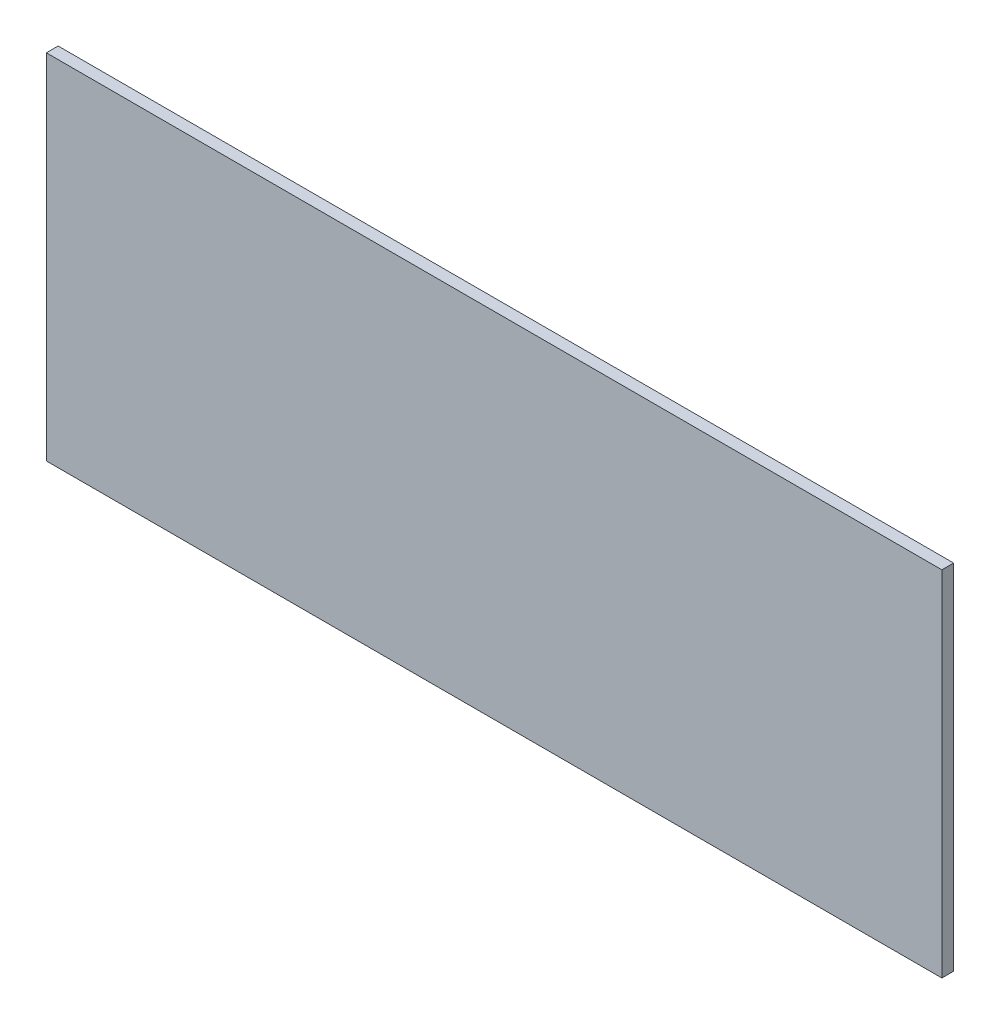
from build123d import *

# Parameters (mm, degrees)
AUFSATZ_LIN_GK_START = 0.1
GK_W                 = 38
GK_H                 = 15
AUFSATZ_LIN_GK_DEPTH = 0.5


with BuildPart() as part:
    # GK → Aufsatz-Lin_GK (new body)
    with BuildSketch(Plane.XY.offset(AUFSATZ_LIN_GK_START)):
        with Locations((4, 0)):
            Rectangle(GK_W, GK_H)
    extrude(amount=AUFSATZ_LIN_GK_DEPTH)


solid = part.part
